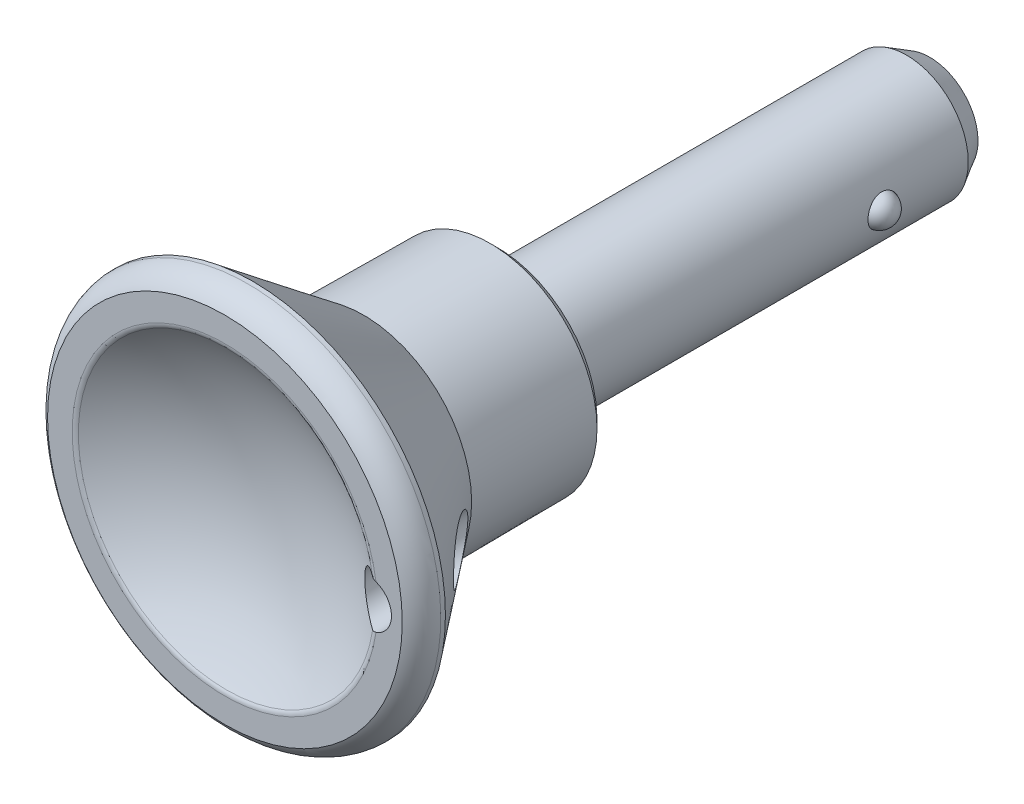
ISO-10303-21;
HEADER;
FILE_DESCRIPTION(('STEP AP214'),'2;1');
FILE_NAME('part.step','',(''),(''),'','','');
FILE_SCHEMA(('AUTOMOTIVE_DESIGN { 1 0 10303 214 1 1 1 1 }'));
ENDSEC;
DATA;
#1=APPLICATION_CONTEXT('core data for automotive mechanical design processes');
#2=APPLICATION_PROTOCOL_DEFINITION('international standard','automotive_design',2000,#1);
#3=PRODUCT_CONTEXT('',#1,'mechanical');
#4=PRODUCT('Part','Part','',(#3));
#5=PRODUCT_RELATED_PRODUCT_CATEGORY('part','',(#4));
#6=PRODUCT_DEFINITION_FORMATION('','',#4);
#7=PRODUCT_DEFINITION_CONTEXT('part definition',#1,'design');
#8=PRODUCT_DEFINITION('design','',#6,#7);
#9=PRODUCT_DEFINITION_SHAPE('','',#8);
#10=(LENGTH_UNIT() NAMED_UNIT(*) SI_UNIT(.MILLI.,.METRE.));
#11=(NAMED_UNIT(*) PLANE_ANGLE_UNIT() SI_UNIT($,.RADIAN.));
#12=(NAMED_UNIT(*) SI_UNIT($,.STERADIAN.) SOLID_ANGLE_UNIT());
#13=UNCERTAINTY_MEASURE_WITH_UNIT(LENGTH_MEASURE(1.E-05),#10,'distance_accuracy_value','');
#14=(GEOMETRIC_REPRESENTATION_CONTEXT(3) GLOBAL_UNCERTAINTY_ASSIGNED_CONTEXT((#13)) GLOBAL_UNIT_ASSIGNED_CONTEXT((#10,
#11,#12)) REPRESENTATION_CONTEXT('',''));
#15=CARTESIAN_POINT('',(0.,0.,0.));
#16=DIRECTION('',(0.,0.,1.));
#17=DIRECTION('',(1.,0.,0.));
#18=AXIS2_PLACEMENT_3D('',#15,#16,#17);
#19=CARTESIAN_POINT('',(3.13397459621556,-3.17158441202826,-28.));
#20=DIRECTION('',(0.,0.,-1.));
#21=DIRECTION('',(-1.,0.,0.));
#22=AXIS2_PLACEMENT_3D('',#19,#20,#21);
#23=PLANE('',#22);
#24=CARTESIAN_POINT('',(0.,0.,-28.));
#25=DIRECTION('',(0.,0.,1.));
#26=DIRECTION('',(0.,-1.,0.));
#27=AXIS2_PLACEMENT_3D('',#24,#25,#26);
#28=CIRCLE('',#27,3.13397459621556);
#29=CARTESIAN_POINT('',(0.,-3.13397459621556,-28.));
#30=VERTEX_POINT('',#29);
#31=EDGE_CURVE('E70',#30,#30,#28,.T.);
#32=ORIENTED_EDGE('',*,*,#31,.F.);
#33=EDGE_LOOP('',(#32));
#34=FACE_BOUND('',#33,.T.);
#35=ADVANCED_FACE('F14',(#34),#23,.T.);
#36=CARTESIAN_POINT('',(3.88177446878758,0.,-21.));
#37=DIRECTION('',(1.,0.,0.));
#38=DIRECTION('',(0.,-1.,0.));
#39=AXIS2_PLACEMENT_3D('',#36,#37,#38);
#40=CYLINDRICAL_SURFACE('',#39,1.);
#41=CARTESIAN_POINT('',(3.88177446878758,0.,-21.));
#42=DIRECTION('',(1.,0.,0.));
#43=DIRECTION('',(0.,-1.,0.));
#44=AXIS2_PLACEMENT_3D('',#41,#42,#43);
#45=CIRCLE('',#44,1.);
#46=CARTESIAN_POINT('',(3.88177451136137,-0.96531168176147,-21.2611002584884));
#47=VERTEX_POINT('',#46);
#48=CARTESIAN_POINT('',(3.88177446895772,0.96531185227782,-21.2610996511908));
#49=VERTEX_POINT('',#48);
#50=EDGE_CURVE('E17',#47,#49,#45,.T.);
#51=ORIENTED_EDGE('',*,*,#50,.F.);
#52=CARTESIAN_POINT('',(3.88177448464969,0.965311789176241,-21.2610998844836));
#53=CARTESIAN_POINT('',(3.88540385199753,0.950638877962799,-21.3155094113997));
#54=CARTESIAN_POINT('',(3.89014046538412,0.931319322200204,-21.3685420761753));
#55=CARTESIAN_POINT('',(3.90112983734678,0.884199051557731,-21.4704413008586));
#56=CARTESIAN_POINT('',(3.90738045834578,0.856410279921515,-21.5193136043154));
#57=CARTESIAN_POINT('',(3.92071189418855,0.793126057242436,-21.6116284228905));
#58=CARTESIAN_POINT('',(3.92779250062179,0.757632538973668,-21.6550722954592));
#59=CARTESIAN_POINT('',(3.94199278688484,0.679892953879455,-21.7354385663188));
#60=CARTESIAN_POINT('',(3.94911247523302,0.637645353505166,-21.7723594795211));
#61=CARTESIAN_POINT('',(3.96270366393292,0.546907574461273,-21.8391103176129));
#62=CARTESIAN_POINT('',(3.96916547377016,0.498343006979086,-21.8688412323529));
#63=CARTESIAN_POINT('',(3.9806028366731,0.396745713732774,-21.9196822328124));
#64=CARTESIAN_POINT('',(3.98557913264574,0.343715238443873,-21.9407966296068));
#65=CARTESIAN_POINT('',(3.99291972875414,0.242471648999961,-21.9713879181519));
#66=CARTESIAN_POINT('',(3.99555479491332,0.194645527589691,-21.9820925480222));
#67=CARTESIAN_POINT('',(3.99909511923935,0.0978826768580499,-21.9963986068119));
#68=CARTESIAN_POINT('',(4.00000061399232,0.0489461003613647,-22.0000010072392));
#69=CARTESIAN_POINT('',(3.99999930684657,-0.0552566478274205,-21.999998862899));
#70=CARTESIAN_POINT('',(3.99884379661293,-0.110525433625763,-21.9954052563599));
#71=CARTESIAN_POINT('',(3.99434700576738,-0.219475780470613,-21.9771816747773));
#72=CARTESIAN_POINT('',(3.9910047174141,-0.273156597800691,-21.9635475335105));
#73=CARTESIAN_POINT('',(3.98250420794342,-0.377347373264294,-21.9277072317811));
#74=CARTESIAN_POINT('',(3.97734807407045,-0.427860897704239,-21.9055109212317));
#75=CARTESIAN_POINT('',(3.96576893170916,-0.524447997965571,-21.8532124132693));
#76=CARTESIAN_POINT('',(3.95934587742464,-0.570521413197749,-21.8231099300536));
#77=CARTESIAN_POINT('',(3.94578204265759,-0.657873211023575,-21.7551953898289));
#78=CARTESIAN_POINT('',(3.93863012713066,-0.699046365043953,-21.7172502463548));
#79=CARTESIAN_POINT('',(3.92448848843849,-0.774509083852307,-21.6350198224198));
#80=CARTESIAN_POINT('',(3.91749874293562,-0.808799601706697,-21.5907354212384));
#81=CARTESIAN_POINT('',(3.90495270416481,-0.867284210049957,-21.5004846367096));
#82=CARTESIAN_POINT('',(3.8993282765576,-0.892041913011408,-21.4548922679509));
#83=CARTESIAN_POINT('',(3.88941506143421,-0.934286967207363,-21.3602904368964));
#84=CARTESIAN_POINT('',(3.88512710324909,-0.951769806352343,-21.3112788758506));
#85=CARTESIAN_POINT('',(3.88177448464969,-0.965311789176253,-21.2610998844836));
#86=B_SPLINE_CURVE_WITH_KNOTS('',3,(#52,#53,#54,#55,#56,#57,#58,#59,#60,#61,#62,#63,#64,#65,#66,
#67,#68,#69,#70,#71,#72,#73,#74,#75,#76,#77,#78,#79,#80,#81,#82,#83,#84,#85),.UNSPECIFIED.,.F.,
.F.,(4,2,2,2,2,2,2,2,2,2,2,2,2,2,2,2,4),(0.,0.169132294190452,0.338027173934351,
0.506879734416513,0.67577068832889,0.8468695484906,1.01788269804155,1.16458276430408,
1.31126276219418,1.47685399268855,1.6425215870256,1.80799916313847,1.97348272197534,
2.1420468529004,2.31058762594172,2.46651284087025,2.62253462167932),.UNSPECIFIED.);
#87=EDGE_CURVE('E50',#49,#47,#86,.T.);
#88=ORIENTED_EDGE('',*,*,#87,.F.);
#89=EDGE_LOOP('',(#51,#88));
#90=FACE_BOUND('',#89,.T.);
#91=ADVANCED_FACE('F53',(#90),#40,.F.);
#92=CARTESIAN_POINT('',(3.74,0.,-21.));
#93=DIRECTION('',(0.,-1.,0.));
#94=DIRECTION('',(0.,0.,-1.));
#95=AXIS2_PLACEMENT_3D('',#92,#93,#94);
#96=SPHERICAL_SURFACE('',#95,1.01);
#97=CARTESIAN_POINT('',(3.88177455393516,0.965311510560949,-20.7388991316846));
#98=CARTESIAN_POINT('',(3.87947589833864,0.974537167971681,-20.7717537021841));
#99=CARTESIAN_POINT('',(3.87758596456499,0.982015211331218,-20.8051052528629));
#100=CARTESIAN_POINT('',(3.87470673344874,0.993322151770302,-20.8719408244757));
#101=CARTESIAN_POINT('',(3.8737042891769,0.997204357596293,-20.9054152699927));
#102=CARTESIAN_POINT('',(3.87228725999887,1.00270077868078,-20.9925132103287));
#103=CARTESIAN_POINT('',(3.87257020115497,1.00161876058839,-21.0463531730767));
#104=CARTESIAN_POINT('',(3.87471439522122,0.993273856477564,-21.1269570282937));
#105=CARTESIAN_POINT('',(3.87573945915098,0.989279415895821,-21.1541316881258));
#106=CARTESIAN_POINT('',(3.87834788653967,0.979001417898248,-21.2080101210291));
#107=CARTESIAN_POINT('',(3.87993110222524,0.972718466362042,-21.2347140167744));
#108=CARTESIAN_POINT('',(3.88177455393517,0.965311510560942,-21.2611008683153));
#109=B_SPLINE_CURVE_WITH_KNOTS('',3,(#97,#98,#99,#100,#101,#102,#103,#104,#105,#106,#107,#108),
.UNSPECIFIED.,.F.,.F.,(4,2,2,2,2,4),(0.,0.102513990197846,0.203482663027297,0.364121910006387,
0.44649117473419,0.528838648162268),.UNSPECIFIED.);
#110=CARTESIAN_POINT('',(3.88177451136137,0.965311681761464,-20.7388997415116));
#111=VERTEX_POINT('',#110);
#112=EDGE_CURVE('E68',#111,#49,#109,.T.);
#113=ORIENTED_EDGE('',*,*,#112,.F.);
#114=CARTESIAN_POINT('',(3.88177446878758,0.,-21.));
#115=DIRECTION('',(1.,0.,0.));
#116=DIRECTION('',(0.,-1.,0.));
#117=AXIS2_PLACEMENT_3D('',#114,#115,#116);
#118=CIRCLE('',#117,1.);
#119=CARTESIAN_POINT('',(3.88177446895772,-0.96531185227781,-20.7389003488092));
#120=VERTEX_POINT('',#119);
#121=EDGE_CURVE('E57',#120,#111,#118,.F.);
#122=ORIENTED_EDGE('',*,*,#121,.F.);
#123=CARTESIAN_POINT('',(3.88177455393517,-0.965311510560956,-21.2611008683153));
#124=CARTESIAN_POINT('',(3.87947589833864,-0.974537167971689,-21.2282462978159));
#125=CARTESIAN_POINT('',(3.87758596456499,-0.982015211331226,-21.1948947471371));
#126=CARTESIAN_POINT('',(3.87470673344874,-0.99332215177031,-21.1280591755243));
#127=CARTESIAN_POINT('',(3.8737042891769,-0.9972043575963,-21.0945847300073));
#128=CARTESIAN_POINT('',(3.87228725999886,-1.00270077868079,-21.0074867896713));
#129=CARTESIAN_POINT('',(3.87257020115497,-1.00161876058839,-20.9536468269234));
#130=CARTESIAN_POINT('',(3.87471439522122,-0.993273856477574,-20.8730429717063));
#131=CARTESIAN_POINT('',(3.87573945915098,-0.989279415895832,-20.8458683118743));
#132=CARTESIAN_POINT('',(3.87834788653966,-0.979001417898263,-20.791989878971));
#133=CARTESIAN_POINT('',(3.87993110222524,-0.97271846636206,-20.7652859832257));
#134=CARTESIAN_POINT('',(3.88177455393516,-0.965311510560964,-20.7388991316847));
#135=B_SPLINE_CURVE_WITH_KNOTS('',3,(#123,#124,#125,#126,#127,#128,#129,#130,#131,#132,#133,
#134),.UNSPECIFIED.,.F.,.F.,(4,2,2,2,2,4),(0.,0.102513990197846,0.203482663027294,
0.36412191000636,0.446491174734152,0.528838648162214),.UNSPECIFIED.);
#136=EDGE_CURVE('E59',#47,#120,#135,.T.);
#137=ORIENTED_EDGE('',*,*,#136,.F.);
#138=ORIENTED_EDGE('',*,*,#50,.T.);
#139=EDGE_LOOP('',(#113,#122,#137,#138));
#140=FACE_BOUND('',#139,.T.);
#141=ADVANCED_FACE('F60',(#140),#96,.T.);
#142=CARTESIAN_POINT('',(3.88177446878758,0.,-21.));
#143=DIRECTION('',(1.,0.,0.));
#144=DIRECTION('',(0.,-1.,0.));
#145=AXIS2_PLACEMENT_3D('',#142,#143,#144);
#146=CYLINDRICAL_SURFACE('',#145,1.);
#147=CARTESIAN_POINT('',(3.88177448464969,-0.96531178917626,-20.7389001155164));
#148=CARTESIAN_POINT('',(3.88540385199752,-0.950638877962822,-20.6844905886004));
#149=CARTESIAN_POINT('',(3.89014046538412,-0.931319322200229,-20.6314579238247));
#150=CARTESIAN_POINT('',(3.90112983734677,-0.88419905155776,-20.5295586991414));
#151=CARTESIAN_POINT('',(3.90738045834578,-0.856410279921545,-20.4806863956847));
#152=CARTESIAN_POINT('',(3.92071189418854,-0.793126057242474,-20.3883715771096));
#153=CARTESIAN_POINT('',(3.92779250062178,-0.757632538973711,-20.3449277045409));
#154=CARTESIAN_POINT('',(3.94199278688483,-0.679892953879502,-20.2645614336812));
#155=CARTESIAN_POINT('',(3.94911247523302,-0.637645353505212,-20.2276405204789));
#156=CARTESIAN_POINT('',(3.96270366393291,-0.546907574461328,-20.1608896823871));
#157=CARTESIAN_POINT('',(3.96916547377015,-0.49834300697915,-20.1311587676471));
#158=CARTESIAN_POINT('',(3.98060283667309,-0.396745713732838,-20.0803177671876));
#159=CARTESIAN_POINT('',(3.98557913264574,-0.343715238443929,-20.0592033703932));
#160=CARTESIAN_POINT('',(3.99291972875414,-0.242471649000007,-20.0286120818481));
#161=CARTESIAN_POINT('',(3.99555479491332,-0.194645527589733,-20.0179074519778));
#162=CARTESIAN_POINT('',(3.99909511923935,-0.0978826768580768,-20.0036013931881));
#163=CARTESIAN_POINT('',(4.00000061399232,-0.0489461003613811,-19.9999989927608));
#164=CARTESIAN_POINT('',(3.99999930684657,0.0552566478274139,-20.000001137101));
#165=CARTESIAN_POINT('',(3.99884379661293,0.110525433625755,-20.0045947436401));
#166=CARTESIAN_POINT('',(3.99434700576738,0.219475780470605,-20.0228183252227));
#167=CARTESIAN_POINT('',(3.9910047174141,0.273156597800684,-20.0364524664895));
#168=CARTESIAN_POINT('',(3.98250420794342,0.377347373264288,-20.0722927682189));
#169=CARTESIAN_POINT('',(3.97734807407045,0.427860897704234,-20.0944890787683));
#170=CARTESIAN_POINT('',(3.96576893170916,0.524447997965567,-20.1467875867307));
#171=CARTESIAN_POINT('',(3.95934587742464,0.570521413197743,-20.1768900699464));
#172=CARTESIAN_POINT('',(3.94578204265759,0.657873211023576,-20.2448046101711));
#173=CARTESIAN_POINT('',(3.93863012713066,0.69904636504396,-20.2827497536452));
#174=CARTESIAN_POINT('',(3.92448848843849,0.77450908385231,-20.3649801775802));
#175=CARTESIAN_POINT('',(3.91749874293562,0.80879960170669,-20.4092645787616));
#176=CARTESIAN_POINT('',(3.90495270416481,0.867284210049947,-20.4995153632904));
#177=CARTESIAN_POINT('',(3.8993282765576,0.892041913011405,-20.5451077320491));
#178=CARTESIAN_POINT('',(3.8894150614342,0.93428696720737,-20.6397095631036));
#179=CARTESIAN_POINT('',(3.88512710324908,0.951769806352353,-20.6887211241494));
#180=CARTESIAN_POINT('',(3.88177448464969,0.965311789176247,-20.7389001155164));
#181=B_SPLINE_CURVE_WITH_KNOTS('',3,(#147,#148,#149,#150,#151,#152,#153,#154,#155,#156,#157,
#158,#159,#160,#161,#162,#163,#164,#165,#166,#167,#168,#169,#170,#171,#172,#173,#174,#175,#176,
#177,#178,#179,#180),.UNSPECIFIED.,.F.,.F.,(4,2,2,2,2,2,2,2,2,2,2,2,2,2,2,2,4),(0.,
0.169132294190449,0.338027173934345,0.506879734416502,0.675770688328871,0.846869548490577,
1.01788269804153,1.16458276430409,1.31126276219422,1.47685399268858,1.64252158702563,
1.80799916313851,1.97348272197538,2.14204685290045,2.3105876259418,2.46651284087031,
2.62253462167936),.UNSPECIFIED.);
#182=EDGE_CURVE('E64',#120,#111,#181,.T.);
#183=ORIENTED_EDGE('',*,*,#182,.F.);
#184=ORIENTED_EDGE('',*,*,#121,.T.);
#185=EDGE_LOOP('',(#183,#184));
#186=FACE_BOUND('',#185,.T.);
#187=ADVANCED_FACE('F97',(#186),#146,.F.);
#188=CARTESIAN_POINT('',(0.,0.,-28.));
#189=DIRECTION('',(0.,0.,1.));
#190=DIRECTION('',(0.,-1.,0.));
#191=AXIS2_PLACEMENT_3D('',#188,#189,#190);
#192=CONICAL_SURFACE('',#191,3.13397459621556,0.523598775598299);
#193=CARTESIAN_POINT('',(0.,0.,-26.5));
#194=DIRECTION('',(0.,0.,1.));
#195=DIRECTION('',(1.,0.,0.));
#196=AXIS2_PLACEMENT_3D('',#193,#194,#195);
#197=CIRCLE('',#196,4.);
#198=CARTESIAN_POINT('',(4.,0.,-26.5));
#199=VERTEX_POINT('',#198);
#200=EDGE_CURVE('E102',#199,#199,#197,.T.);
#201=ORIENTED_EDGE('',*,*,#200,.F.);
#202=EDGE_LOOP('',(#201));
#203=FACE_BOUND('',#202,.T.);
#204=ORIENTED_EDGE('',*,*,#31,.T.);
#205=EDGE_LOOP('',(#204));
#206=FACE_BOUND('',#205,.T.);
#207=ADVANCED_FACE('F201',(#203,#206),#192,.T.);
#208=CARTESIAN_POINT('',(0.,0.,0.));
#209=DIRECTION('',(0.,0.,1.));
#210=DIRECTION('',(0.,-1.,0.));
#211=AXIS2_PLACEMENT_3D('',#208,#209,#210);
#212=CYLINDRICAL_SURFACE('',#211,4.);
#213=ORIENTED_EDGE('',*,*,#112,.T.);
#214=ORIENTED_EDGE('',*,*,#87,.T.);
#215=ORIENTED_EDGE('',*,*,#136,.T.);
#216=ORIENTED_EDGE('',*,*,#182,.T.);
#217=EDGE_LOOP('',(#213,#214,#215,#216));
#218=FACE_BOUND('',#217,.T.);
#219=CARTESIAN_POINT('',(0.,0.,0.));
#220=DIRECTION('',(0.,0.,1.));
#221=DIRECTION('',(0.,-1.,0.));
#222=AXIS2_PLACEMENT_3D('',#219,#220,#221);
#223=CIRCLE('',#222,4.);
#224=CARTESIAN_POINT('',(0.,-4.,0.));
#225=VERTEX_POINT('',#224);
#226=EDGE_CURVE('E186',#225,#225,#223,.T.);
#227=ORIENTED_EDGE('',*,*,#226,.F.);
#228=EDGE_LOOP('',(#227));
#229=FACE_BOUND('',#228,.T.);
#230=ORIENTED_EDGE('',*,*,#200,.T.);
#231=EDGE_LOOP('',(#230));
#232=FACE_BOUND('',#231,.T.);
#233=ADVANCED_FACE('F66',(#218,#229,#232),#212,.T.);
#234=CARTESIAN_POINT('',(6.4240762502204,-6.50116727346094,0.));
#235=DIRECTION('',(0.,0.,-1.));
#236=DIRECTION('',(-1.,0.,0.));
#237=AXIS2_PLACEMENT_3D('',#234,#235,#236);
#238=PLANE('',#237);
#239=ORIENTED_EDGE('',*,*,#226,.T.);
#240=EDGE_LOOP('',(#239));
#241=FACE_BOUND('',#240,.T.);
#242=CARTESIAN_POINT('',(0.,0.,0.));
#243=DIRECTION('',(0.,0.,1.));
#244=DIRECTION('',(0.,-1.,0.));
#245=AXIS2_PLACEMENT_3D('',#242,#243,#244);
#246=CIRCLE('',#245,6.4240762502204);
#247=CARTESIAN_POINT('',(0.,-6.4240762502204,0.));
#248=VERTEX_POINT('',#247);
#249=EDGE_CURVE('E154',#248,#248,#246,.T.);
#250=ORIENTED_EDGE('',*,*,#249,.F.);
#251=EDGE_LOOP('',(#250));
#252=FACE_BOUND('',#251,.T.);
#253=ADVANCED_FACE('F234',(#241,#252),#238,.T.);
#254=CARTESIAN_POINT('',(0.,0.,0.));
#255=DIRECTION('',(0.,0.,1.));
#256=DIRECTION('',(0.,-1.,0.));
#257=AXIS2_PLACEMENT_3D('',#254,#255,#256);
#258=CONICAL_SURFACE('',#257,6.4240762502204,0.789761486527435);
#259=CARTESIAN_POINT('',(0.,0.,0.499980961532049));
#260=DIRECTION('',(0.,0.,-1.));
#261=DIRECTION('',(1.,0.,0.));
#262=AXIS2_PLACEMENT_3D('',#259,#260,#261);
#263=CIRCLE('',#262,6.92843951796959);
#264=CARTESIAN_POINT('',(6.92843951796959,0.,0.499980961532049));
#265=VERTEX_POINT('',#264);
#266=EDGE_CURVE('E180',#265,#265,#263,.F.);
#267=ORIENTED_EDGE('',*,*,#266,.F.);
#268=EDGE_LOOP('',(#267));
#269=FACE_BOUND('',#268,.T.);
#270=ORIENTED_EDGE('',*,*,#249,.T.);
#271=EDGE_LOOP('',(#270));
#272=FACE_BOUND('',#271,.T.);
#273=ADVANCED_FACE('F240',(#269,#272),#258,.T.);
#274=CARTESIAN_POINT('',(0.,0.,0.499980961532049));
#275=DIRECTION('',(0.,0.,1.));
#276=DIRECTION('',(0.,-1.,0.));
#277=AXIS2_PLACEMENT_3D('',#274,#275,#276);
#278=CONICAL_SURFACE('',#277,6.92843951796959,0.00872664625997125);
#279=CARTESIAN_POINT('',(0.,0.,8.7));
#280=DIRECTION('',(0.,0.,-1.));
#281=DIRECTION('',(1.,0.,0.));
#282=AXIS2_PLACEMENT_3D('',#279,#280,#281);
#283=CIRCLE('',#282,7.);
#284=CARTESIAN_POINT('',(7.,0.,8.7));
#285=VERTEX_POINT('',#284);
#286=EDGE_CURVE('E176',#285,#285,#283,.F.);
#287=ORIENTED_EDGE('',*,*,#286,.F.);
#288=EDGE_LOOP('',(#287));
#289=FACE_BOUND('',#288,.T.);
#290=ORIENTED_EDGE('',*,*,#266,.T.);
#291=EDGE_LOOP('',(#290));
#292=FACE_BOUND('',#291,.T.);
#293=ADVANCED_FACE('F246',(#289,#292),#278,.T.);
#294=CARTESIAN_POINT('',(0.,0.,16.2));
#295=DIRECTION('',(0.,0.,1.));
#296=DIRECTION('',(0.,-1.,0.));
#297=AXIS2_PLACEMENT_3D('',#294,#295,#296);
#298=CYLINDRICAL_SURFACE('',#297,12.5);
#299=CARTESIAN_POINT('',(0.,0.,15.9));
#300=DIRECTION('',(0.,0.,-1.));
#301=DIRECTION('',(1.,0.,0.));
#302=AXIS2_PLACEMENT_3D('',#299,#300,#301);
#303=CIRCLE('',#302,12.5);
#304=CARTESIAN_POINT('',(12.5,0.,15.9));
#305=VERTEX_POINT('',#304);
#306=EDGE_CURVE('E177',#305,#305,#303,.T.);
#307=ORIENTED_EDGE('',*,*,#306,.F.);
#308=EDGE_LOOP('',(#307));
#309=FACE_BOUND('',#308,.T.);
#310=CARTESIAN_POINT('',(0.,0.,16.2));
#311=DIRECTION('',(0.,0.,1.));
#312=DIRECTION('',(0.,-1.,0.));
#313=AXIS2_PLACEMENT_3D('',#310,#311,#312);
#314=CIRCLE('',#313,12.5);
#315=CARTESIAN_POINT('',(0.,-12.5,16.2));
#316=VERTEX_POINT('',#315);
#317=EDGE_CURVE('E153',#316,#316,#314,.T.);
#318=ORIENTED_EDGE('',*,*,#317,.F.);
#319=EDGE_LOOP('',(#318));
#320=FACE_BOUND('',#319,.T.);
#321=ADVANCED_FACE('F254',(#309,#320),#298,.T.);
#322=CARTESIAN_POINT('',(0.,0.,8.7));
#323=DIRECTION('',(0.,0.,1.));
#324=DIRECTION('',(0.,-1.,0.));
#325=AXIS2_PLACEMENT_3D('',#322,#323,#324);
#326=CONICAL_SURFACE('',#325,7.,0.65233090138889);
#327=CARTESIAN_POINT('',(9.05806451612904,-1.48036050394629,11.5515077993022));
#328=CARTESIAN_POINT('',(8.99141512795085,-1.46946825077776,11.4631001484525));
#329=CARTESIAN_POINT('',(8.92550148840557,-1.45408557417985,11.3746905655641));
#330=CARTESIAN_POINT('',(8.79556366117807,-1.41427171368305,11.1984472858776));
#331=CARTESIAN_POINT('',(8.73154031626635,-1.38983655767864,11.1106138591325));
#332=CARTESIAN_POINT('',(8.60623315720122,-1.33170423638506,10.9367585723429));
#333=CARTESIAN_POINT('',(8.54493725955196,-1.29805393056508,10.8507298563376));
#334=CARTESIAN_POINT('',(8.42544336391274,-1.22074353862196,10.6811358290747));
#335=CARTESIAN_POINT('',(8.36724184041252,-1.17709515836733,10.5975677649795));
#336=CARTESIAN_POINT('',(8.2692294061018,-1.09114708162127,10.4552980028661));
#337=CARTESIAN_POINT('',(8.22852162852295,-1.05135683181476,10.3957022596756));
#338=CARTESIAN_POINT('',(8.14989980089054,-0.964725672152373,10.2796936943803));
#339=CARTESIAN_POINT('',(8.11198828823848,-0.917878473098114,10.2232837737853));
#340=CARTESIAN_POINT('',(8.03963417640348,-0.815744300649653,10.1148327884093));
#341=CARTESIAN_POINT('',(8.00522654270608,-0.760383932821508,10.0628364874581));
#342=CARTESIAN_POINT('',(7.94192848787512,-0.640477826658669,9.96655825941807));
#343=CARTESIAN_POINT('',(7.91302454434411,-0.575955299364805,9.92225744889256));
#344=CARTESIAN_POINT('',(7.87251252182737,-0.463057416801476,9.85986137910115));
#345=CARTESIAN_POINT('',(7.85846623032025,-0.417573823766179,9.83814176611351));
#346=CARTESIAN_POINT('',(7.83441768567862,-0.323152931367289,9.80086955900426));
#347=CARTESIAN_POINT('',(7.82440740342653,-0.274222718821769,9.78530472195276));
#348=CARTESIAN_POINT('',(7.81132335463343,-0.187620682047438,9.76493500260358));
#349=CARTESIAN_POINT('',(7.80710048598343,-0.150537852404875,9.75835039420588));
#350=CARTESIAN_POINT('',(7.80143783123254,-0.0756412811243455,9.74951765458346));
#351=CARTESIAN_POINT('',(7.79999798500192,-0.0378275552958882,9.74726942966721));
#352=CARTESIAN_POINT('',(7.8000025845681,0.048520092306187,9.74727695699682));
#353=CARTESIAN_POINT('',(7.80237736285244,0.097062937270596,9.75098545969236));
#354=CARTESIAN_POINT('',(7.81164444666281,0.192651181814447,9.76543406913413));
#355=CARTESIAN_POINT('',(7.81854204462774,0.239694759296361,9.77618241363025));
#356=CARTESIAN_POINT('',(7.83829683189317,0.341610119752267,9.80688772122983));
#357=CARTESIAN_POINT('',(7.85215507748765,0.39581717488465,9.82838678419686));
#358=CARTESIAN_POINT('',(7.8845198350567,0.499375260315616,9.87838349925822));
#359=CARTESIAN_POINT('',(7.90303499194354,0.548717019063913,9.9068941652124));
#360=CARTESIAN_POINT('',(7.95423062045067,0.66706820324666,9.98533549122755));
#361=CARTESIAN_POINT('',(7.9892435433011,0.732796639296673,10.0386516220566));
#362=CARTESIAN_POINT('',(8.06472209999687,0.853932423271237,10.1525776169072));
#363=CARTESIAN_POINT('',(8.10520064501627,0.909314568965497,10.2132047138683));
#364=CARTESIAN_POINT('',(8.18383548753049,1.00367842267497,10.3298982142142));
#365=CARTESIAN_POINT('',(8.22147534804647,1.04387385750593,10.3853483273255));
#366=CARTESIAN_POINT('',(8.29898008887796,1.11841530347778,10.4986148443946));
#367=CARTESIAN_POINT('',(8.33884646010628,1.15275733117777,10.556432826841));
#368=CARTESIAN_POINT('',(8.42042546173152,1.21614962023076,10.6737908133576));
#369=CARTESIAN_POINT('',(8.46214099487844,1.24519116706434,10.7333334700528));
#370=CARTESIAN_POINT('',(8.54706483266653,1.29830522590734,10.8535675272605));
#371=CARTESIAN_POINT('',(8.59027353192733,1.32237641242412,10.9142592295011));
#372=CARTESIAN_POINT('',(8.69675324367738,1.37513054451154,11.0626135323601));
#373=CARTESIAN_POINT('',(8.76068198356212,1.40136483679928,11.150681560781));
#374=CARTESIAN_POINT('',(8.89058399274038,1.44466814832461,11.3275915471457));
#375=CARTESIAN_POINT('',(8.95655819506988,1.46173291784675,11.4164338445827));
#376=CARTESIAN_POINT('',(9.09008194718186,1.48679092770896,11.5942301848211));
#377=CARTESIAN_POINT('',(9.15763151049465,1.4947840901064,11.683184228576));
#378=CARTESIAN_POINT('',(9.29378809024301,1.50153429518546,11.8605390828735));
#379=CARTESIAN_POINT('',(9.36239469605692,1.5002948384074,11.9489400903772));
#380=CARTESIAN_POINT('',(9.53896432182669,1.48478544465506,12.1740527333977));
#381=CARTESIAN_POINT('',(9.64741582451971,1.46359594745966,12.3100469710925));
#382=CARTESIAN_POINT('',(9.80896256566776,1.41213790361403,12.5095339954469));
#383=CARTESIAN_POINT('',(9.86259038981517,1.39172486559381,12.5752398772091));
#384=CARTESIAN_POINT('',(9.96902195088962,1.34380635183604,12.7046889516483));
#385=CARTESIAN_POINT('',(10.021826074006,1.31630431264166,12.7684330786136));
#386=CARTESIAN_POINT('',(10.1398540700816,1.2452226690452,12.9099256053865));
#387=CARTESIAN_POINT('',(10.2046458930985,1.19931241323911,12.9868895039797));
#388=CARTESIAN_POINT('',(10.3299573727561,1.09357010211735,13.1345591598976));
#389=CARTESIAN_POINT('',(10.3904821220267,1.03375502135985,13.2052724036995));
#390=CARTESIAN_POINT('',(10.4895745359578,0.916081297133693,13.3202576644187));
#391=CARTESIAN_POINT('',(10.5297805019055,0.861692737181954,13.3666468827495));
#392=CARTESIAN_POINT('',(10.6043536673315,0.743973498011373,13.452316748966));
#393=CARTESIAN_POINT('',(10.6387288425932,0.680655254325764,13.4916071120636));
#394=CARTESIAN_POINT('',(10.6925693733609,0.560424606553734,13.5529446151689));
#395=CARTESIAN_POINT('',(10.7136506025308,0.505208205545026,13.5768833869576));
#396=CARTESIAN_POINT('',(10.7495749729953,0.390302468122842,13.6176027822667));
#397=CARTESIAN_POINT('',(10.7644289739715,0.330621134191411,13.6343958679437));
#398=CARTESIAN_POINT('',(10.7836092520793,0.225596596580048,13.6560593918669));
#399=CARTESIAN_POINT('',(10.7897268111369,0.180990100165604,13.6629607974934));
#400=CARTESIAN_POINT('',(10.7979243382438,0.0909301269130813,13.6722061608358));
#401=CARTESIAN_POINT('',(10.8000037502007,0.0454765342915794,13.6745494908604));
#402=CARTESIAN_POINT('',(10.799994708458,-0.064167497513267,13.6745397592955));
#403=CARTESIAN_POINT('',(10.795841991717,-0.128380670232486,13.6698606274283));
#404=CARTESIAN_POINT('',(10.7796239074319,-0.254506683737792,13.6515601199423));
#405=CARTESIAN_POINT('',(10.7675483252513,-0.316416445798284,13.6379272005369));
#406=CARTESIAN_POINT('',(10.7366563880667,-0.435644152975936,13.6029693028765));
#407=CARTESIAN_POINT('',(10.7178919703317,-0.492993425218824,13.5817035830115));
#408=CARTESIAN_POINT('',(10.6748799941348,-0.602645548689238,13.5328118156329));
#409=CARTESIAN_POINT('',(10.6506301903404,-0.65494632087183,13.5051831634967));
#410=CARTESIAN_POINT('',(10.5859735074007,-0.776472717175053,13.4312530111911));
#411=CARTESIAN_POINT('',(10.5432056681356,-0.842728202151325,13.3821425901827));
#412=CARTESIAN_POINT('',(10.4516580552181,-0.964099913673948,13.2763616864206));
#413=CARTESIAN_POINT('',(10.4028645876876,-1.01918998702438,13.2196739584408));
#414=CARTESIAN_POINT('',(10.2766029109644,-1.14345503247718,13.0719673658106));
#415=CARTESIAN_POINT('',(10.1967753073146,-1.20635475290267,12.9777102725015));
#416=CARTESIAN_POINT('',(10.0329696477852,-1.3123614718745,12.7820645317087));
#417=CARTESIAN_POINT('',(9.94898466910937,-1.35543413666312,12.6806638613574));
#418=CARTESIAN_POINT('',(9.79718248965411,-1.41705079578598,12.4951419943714));
#419=CARTESIAN_POINT('',(9.72964852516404,-1.43883766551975,12.4118303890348));
#420=CARTESIAN_POINT('',(9.59439459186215,-1.47247845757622,12.2433068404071));
#421=CARTESIAN_POINT('',(9.52667453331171,-1.48432617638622,12.1580937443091));
#422=CARTESIAN_POINT('',(9.39151350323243,-1.49875216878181,11.9862568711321));
#423=CARTESIAN_POINT('',(9.32407407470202,-1.50130123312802,11.8996295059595));
#424=CARTESIAN_POINT('',(9.19020636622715,-1.49747387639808,11.725837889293));
#425=CARTESIAN_POINT('',(9.12377782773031,-1.49109977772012,11.6386737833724));
#426=CARTESIAN_POINT('',(9.05806451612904,-1.48036050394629,11.5515077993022));
#427=B_SPLINE_CURVE_WITH_KNOTS('',3,(#327,#328,#329,#330,#331,#332,#333,#334,#335,#336,#337,
#338,#339,#340,#341,#342,#343,#344,#345,#346,#347,#348,#349,#350,#351,#352,#353,#354,#355,#356,
#357,#358,#359,#360,#361,#362,#363,#364,#365,#366,#367,#368,#369,#370,#371,#372,#373,#374,#375,
#376,#377,#378,#379,#380,#381,#382,#383,#384,#385,#386,#387,#388,#389,#390,#391,#392,#393,#394,
#395,#396,#397,#398,#399,#400,#401,#402,#403,#404,#405,#406,#407,#408,#409,#410,#411,#412,#413,
#414,#415,#416,#417,#418,#419,#420,#421,#422,#423,#424,#425,#426),.UNSPECIFIED.,.T.,.F.,(4,2,2,
2,2,2,2,2,2,2,2,2,2,2,2,2,2,2,2,2,2,2,2,2,2,2,2,2,2,2,2,2,2,2,2,2,2,2,2,2,2,2,2,2,2,2,2,2,2,4),
(0.,0.333658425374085,0.667463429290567,0.999601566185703,1.33135280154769,1.57826788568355,
1.82540433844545,2.07480511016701,2.32358497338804,2.4800563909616,2.63621497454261,
2.74958301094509,2.86294859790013,3.00835870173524,3.15393926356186,3.33275537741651,
3.51190592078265,3.78514778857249,4.0590467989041,4.29316938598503,4.52745067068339,
4.76211373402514,4.9968392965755,5.33221840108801,5.66775280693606,6.00329009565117,
6.33870017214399,6.86226215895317,7.12372139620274,7.38505412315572,7.71589293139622,
8.04632996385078,8.29159071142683,8.5365132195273,8.72709088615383,8.91733480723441,
9.05359735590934,9.18987866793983,9.38217192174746,9.57471358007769,9.76579164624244,
9.95694806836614,10.2340958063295,10.5118854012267,10.9254412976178,11.3397106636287,
11.6675345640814,11.995562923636,12.3246208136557,12.6535930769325),.UNSPECIFIED.);
#428=CARTESIAN_POINT('',(9.05806451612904,-1.48036050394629,11.5515077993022));
#429=VERTEX_POINT('',#428);
#430=EDGE_CURVE('E141',#429,#429,#427,.T.);
#431=ORIENTED_EDGE('',*,*,#430,.F.);
#432=EDGE_LOOP('',(#431));
#433=FACE_BOUND('',#432,.T.);
#434=ORIENTED_EDGE('',*,*,#306,.T.);
#435=EDGE_LOOP('',(#434));
#436=FACE_BOUND('',#435,.T.);
#437=ORIENTED_EDGE('',*,*,#286,.T.);
#438=EDGE_LOOP('',(#437));
#439=FACE_BOUND('',#438,.T.);
#440=ADVANCED_FACE('F262',(#433,#436,#439),#326,.T.);
#441=CARTESIAN_POINT('',(0.,0.,15.9596620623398));
#442=DIRECTION('',(0.,0.,1.));
#443=DIRECTION('',(0.,-1.,0.));
#444=AXIS2_PLACEMENT_3D('',#441,#442,#443);
#445=TOROIDAL_SURFACE('',#444,10.5144930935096,2.);
#446=ORIENTED_EDGE('',*,*,#317,.T.);
#447=EDGE_LOOP('',(#446));
#448=FACE_BOUND('',#447,.T.);
#449=CARTESIAN_POINT('',(0.,0.,17.7));
#450=DIRECTION('',(0.,0.,1.));
#451=DIRECTION('',(0.,-1.,0.));
#452=AXIS2_PLACEMENT_3D('',#449,#450,#451);
#453=CIRCLE('',#452,11.5);
#454=CARTESIAN_POINT('',(0.,-11.5,17.7));
#455=VERTEX_POINT('',#454);
#456=EDGE_CURVE('E108',#455,#455,#453,.T.);
#457=ORIENTED_EDGE('',*,*,#456,.F.);
#458=EDGE_LOOP('',(#457));
#459=FACE_BOUND('',#458,.T.);
#460=ADVANCED_FACE('F135',(#448,#459),#445,.T.);
#461=CARTESIAN_POINT('',(9.3,0.,9.74688245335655));
#462=DIRECTION('',(0.,0.,1.));
#463=DIRECTION('',(0.,-1.,0.));
#464=AXIS2_PLACEMENT_3D('',#461,#462,#463);
#465=CYLINDRICAL_SURFACE('',#464,1.5);
#466=ORIENTED_EDGE('',*,*,#430,.T.);
#467=EDGE_LOOP('',(#466));
#468=FACE_BOUND('',#467,.T.);
#469=CARTESIAN_POINT('',(9.79838709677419,-1.41478277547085,17.7));
#470=CARTESIAN_POINT('',(9.7696746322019,-1.42493393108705,17.7000278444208));
#471=CARTESIAN_POINT('',(9.74057958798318,-1.43416331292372,17.6978154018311));
#472=CARTESIAN_POINT('',(9.68339626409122,-1.45046247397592,17.688811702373));
#473=CARTESIAN_POINT('',(9.65530246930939,-1.45758512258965,17.6821493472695));
#474=CARTESIAN_POINT('',(9.60265119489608,-1.46937623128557,17.6649718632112));
#475=CARTESIAN_POINT('',(9.5780018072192,-1.47420693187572,17.6548534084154));
#476=CARTESIAN_POINT('',(9.52973678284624,-1.48251466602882,17.6305344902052));
#477=CARTESIAN_POINT('',(9.50616459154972,-1.48595330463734,17.6162348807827));
#478=CARTESIAN_POINT('',(9.48387096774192,-1.48868783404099,17.6));
#479=B_SPLINE_CURVE_WITH_KNOTS('',3,(#469,#470,#471,#472,#473,#474,#475,#476,#477,#478),
.UNSPECIFIED.,.F.,.F.,(4,2,2,2,4),(0.,0.091347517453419,0.180157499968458,0.261045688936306,
0.34403364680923),.UNSPECIFIED.);
#480=CARTESIAN_POINT('',(9.79838709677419,-1.41478277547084,17.7));
#481=VERTEX_POINT('',#480);
#482=CARTESIAN_POINT('',(9.48387096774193,-1.48868783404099,17.6));
#483=VERTEX_POINT('',#482);
#484=EDGE_CURVE('E120',#481,#483,#479,.T.);
#485=ORIENTED_EDGE('',*,*,#484,.F.);
#486=CARTESIAN_POINT('',(9.3,0.,17.7));
#487=DIRECTION('',(0.,0.,1.));
#488=DIRECTION('',(0.,-1.,0.));
#489=AXIS2_PLACEMENT_3D('',#486,#487,#488);
#490=CIRCLE('',#489,1.5);
#491=CARTESIAN_POINT('',(9.79838709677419,1.41478277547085,17.7));
#492=VERTEX_POINT('',#491);
#493=EDGE_CURVE('E32',#492,#481,#490,.F.);
#494=ORIENTED_EDGE('',*,*,#493,.F.);
#495=CARTESIAN_POINT('',(9.79838709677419,1.41478277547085,17.7));
#496=CARTESIAN_POINT('',(9.76967463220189,1.42493393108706,17.7000278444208));
#497=CARTESIAN_POINT('',(9.74057958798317,1.43416331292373,17.6978154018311));
#498=CARTESIAN_POINT('',(9.68339626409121,1.45046247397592,17.688811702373));
#499=CARTESIAN_POINT('',(9.65530246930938,1.45758512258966,17.6821493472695));
#500=CARTESIAN_POINT('',(9.60265119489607,1.46937623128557,17.6649718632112));
#501=CARTESIAN_POINT('',(9.57800180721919,1.47420693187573,17.6548534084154));
#502=CARTESIAN_POINT('',(9.52973678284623,1.48251466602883,17.6305344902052));
#503=CARTESIAN_POINT('',(9.50616459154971,1.48595330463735,17.6162348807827));
#504=CARTESIAN_POINT('',(9.48387096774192,1.48868783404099,17.6));
#505=B_SPLINE_CURVE_WITH_KNOTS('',3,(#495,#496,#497,#498,#499,#500,#501,#502,#503,#504),
.UNSPECIFIED.,.F.,.F.,(4,2,2,2,4),(0.,0.0913475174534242,0.180157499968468,0.261045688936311,
0.344033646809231),.UNSPECIFIED.);
#506=CARTESIAN_POINT('',(9.48387096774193,1.48868783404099,17.6));
#507=VERTEX_POINT('',#506);
#508=EDGE_CURVE('E147',#492,#507,#505,.T.);
#509=ORIENTED_EDGE('',*,*,#508,.T.);
#510=CARTESIAN_POINT('',(9.48387096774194,-1.48868783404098,17.6));
#511=CARTESIAN_POINT('',(9.38181447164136,-1.50126046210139,17.5258231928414));
#512=CARTESIAN_POINT('',(9.27847034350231,-1.50339409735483,17.4514075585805));
#513=CARTESIAN_POINT('',(9.07150168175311,-1.48616897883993,17.3036113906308));
#514=CARTESIAN_POINT('',(8.96788247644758,-1.46662385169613,17.230245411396));
#515=CARTESIAN_POINT('',(8.76570217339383,-1.40554015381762,17.0882393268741));
#516=CARTESIAN_POINT('',(8.66709675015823,-1.36425592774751,17.0195547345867));
#517=CARTESIAN_POINT('',(8.47807170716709,-1.25938003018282,16.8888158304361));
#518=CARTESIAN_POINT('',(8.38761877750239,-1.1958848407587,16.8267343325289));
#519=CARTESIAN_POINT('',(8.24568836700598,-1.06979552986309,16.7298945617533));
#520=CARTESIAN_POINT('',(8.19079097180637,-1.01295594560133,16.692612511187));
#521=CARTESIAN_POINT('',(8.08925811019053,-0.88910286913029,16.6238983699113));
#522=CARTESIAN_POINT('',(8.04262373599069,-0.822088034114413,16.5924670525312));
#523=CARTESIAN_POINT('',(7.95961243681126,-0.678453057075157,16.5366671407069));
#524=CARTESIAN_POINT('',(7.92332116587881,-0.601759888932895,16.5123574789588));
#525=CARTESIAN_POINT('',(7.86387797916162,-0.4413851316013,16.4726071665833));
#526=CARTESIAN_POINT('',(7.84069382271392,-0.357721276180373,16.4571447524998));
#527=CARTESIAN_POINT('',(7.81665644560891,-0.227526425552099,16.4411240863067));
#528=CARTESIAN_POINT('',(7.81042627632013,-0.182354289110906,16.4369745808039));
#529=CARTESIAN_POINT('',(7.80209606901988,-0.0914654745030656,16.4314273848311));
#530=CARTESIAN_POINT('',(7.79999581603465,-0.0457488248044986,16.4300295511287));
#531=CARTESIAN_POINT('',(7.8000067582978,0.0738974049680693,16.4300365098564));
#532=CARTESIAN_POINT('',(7.80550430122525,0.147878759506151,16.4336949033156));
#533=CARTESIAN_POINT('',(7.82172596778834,0.257047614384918,16.4445026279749));
#534=CARTESIAN_POINT('',(7.82847272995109,0.29317049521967,16.4489987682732));
#535=CARTESIAN_POINT('',(7.84452794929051,0.364609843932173,16.4597055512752));
#536=CARTESIAN_POINT('',(7.85383787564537,0.399925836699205,16.4659171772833));
#537=CARTESIAN_POINT('',(7.88533418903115,0.503926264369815,16.4869492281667));
#538=CARTESIAN_POINT('',(7.91114789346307,0.5710604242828,16.5042071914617));
#539=CARTESIAN_POINT('',(7.97122958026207,0.699580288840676,16.5444764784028));
#540=CARTESIAN_POINT('',(8.00550445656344,0.760961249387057,16.5674924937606));
#541=CARTESIAN_POINT('',(8.06330229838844,0.849663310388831,16.6064232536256));
#542=CARTESIAN_POINT('',(8.08431449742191,0.879441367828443,16.6205962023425));
#543=CARTESIAN_POINT('',(8.12808579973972,0.936974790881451,16.6501700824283));
#544=CARTESIAN_POINT('',(8.15084283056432,0.9647324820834,16.6655695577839));
#545=CARTESIAN_POINT('',(8.22150377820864,1.04495101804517,16.7134720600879));
#546=CARTESIAN_POINT('',(8.27178709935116,1.09434151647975,16.7476721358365));
#547=CARTESIAN_POINT('',(8.38550726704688,1.19170689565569,16.8253434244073));
#548=CARTESIAN_POINT('',(8.44976642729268,1.23822096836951,16.8694253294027));
#549=CARTESIAN_POINT('',(8.58287694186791,1.31978473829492,16.961227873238));
#550=CARTESIAN_POINT('',(8.65173257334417,1.35482357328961,17.0089519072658));
#551=CARTESIAN_POINT('',(8.76337185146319,1.4014424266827,17.0867690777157));
#552=CARTESIAN_POINT('',(8.80522580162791,1.41674274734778,17.1160369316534));
#553=CARTESIAN_POINT('',(8.88962205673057,1.44344948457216,17.1752539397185));
#554=CARTESIAN_POINT('',(8.93216367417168,1.45485956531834,17.2052024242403));
#555=CARTESIAN_POINT('',(9.06048356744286,1.4833442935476,17.2958544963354));
#556=CARTESIAN_POINT('',(9.14699642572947,1.49468964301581,17.3573922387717));
#557=CARTESIAN_POINT('',(9.31725275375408,1.50223877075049,17.4793658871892));
#558=CARTESIAN_POINT('',(9.40099551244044,1.49891929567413,17.5397732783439));
#559=CARTESIAN_POINT('',(9.48387096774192,1.48868783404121,17.6));
#560=B_SPLINE_CURVE_WITH_KNOTS('',3,(#510,#511,#512,#513,#514,#515,#516,#517,#518,#519,#520,
#521,#522,#523,#524,#525,#526,#527,#528,#529,#530,#531,#532,#533,#534,#535,#536,#537,#538,#539,
#540,#541,#542,#543,#544,#545,#546,#547,#548,#549,#550,#551,#552,#553,#554,#555,#556,#557,#558,
#559),.UNSPECIFIED.,.F.,.F.,(4,2,2,2,2,2,2,2,2,2,2,2,2,2,2,2,2,2,2,2,2,2,2,2,4),(0.,
0.380173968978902,0.763641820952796,1.14271969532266,1.52017093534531,1.7812816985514,
2.0424269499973,2.30567583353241,2.56827433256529,2.70539664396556,2.84251181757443,
3.06399194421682,3.17494513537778,3.28596205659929,3.50680011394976,3.72781870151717,
3.8450322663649,3.96210870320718,4.19632161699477,4.46759731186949,4.73912905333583,
4.89893578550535,5.05859157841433,5.37775215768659,5.6866146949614),.UNSPECIFIED.);
#561=EDGE_CURVE('E111',#483,#507,#560,.T.);
#562=ORIENTED_EDGE('',*,*,#561,.F.);
#563=EDGE_LOOP('',(#485,#494,#509,#562));
#564=FACE_BOUND('',#563,.T.);
#565=ADVANCED_FACE('F131',(#468,#564),#465,.F.);
#566=CARTESIAN_POINT('',(0.,0.,30.4));
#567=DIRECTION('',(0.,-1.,0.));
#568=DIRECTION('',(0.,0.,1.));
#569=AXIS2_PLACEMENT_3D('',#566,#567,#568);
#570=SPHERICAL_SURFACE('',#569,16.);
#571=ORIENTED_EDGE('',*,*,#561,.T.);
#572=CARTESIAN_POINT('',(0.,0.,17.6));
#573=DIRECTION('',(0.,0.,1.));
#574=DIRECTION('',(0.,-1.,0.));
#575=AXIS2_PLACEMENT_3D('',#572,#573,#574);
#576=CIRCLE('',#575,9.6);
#577=EDGE_CURVE('E23',#483,#507,#576,.F.);
#578=ORIENTED_EDGE('',*,*,#577,.F.);
#579=EDGE_LOOP('',(#571,#578));
#580=FACE_BOUND('',#579,.T.);
#581=ADVANCED_FACE('F127',(#580),#570,.F.);
#582=CARTESIAN_POINT('',(-11.73,-11.4999999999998,17.7));
#583=CARTESIAN_POINT('',(-11.5,-11.4999999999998,17.7));
#584=CARTESIAN_POINT('',(11.5,-11.4999999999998,17.7));
#585=B_SPLINE_CURVE_WITH_KNOTS('',1,(#582,#583,#584),.UNSPECIFIED.,.F.,.F.,(2,1,2),(-0.01,0.,
1.),.UNSPECIFIED.);
#586=DIRECTION('',(0.,1.,0.));
#587=VECTOR('',#586,1.);
#588=SURFACE_OF_LINEAR_EXTRUSION('',#585,#587);
#589=ORIENTED_EDGE('',*,*,#493,.T.);
#590=CARTESIAN_POINT('',(0.,0.,17.7));
#591=DIRECTION('',(0.,0.,1.));
#592=DIRECTION('',(0.,-1.,0.));
#593=AXIS2_PLACEMENT_3D('',#590,#591,#592);
#594=CIRCLE('',#593,9.9);
#595=EDGE_CURVE('E9',#492,#481,#594,.T.);
#596=ORIENTED_EDGE('',*,*,#595,.F.);
#597=EDGE_LOOP('',(#589,#596));
#598=FACE_BOUND('',#597,.T.);
#599=ORIENTED_EDGE('',*,*,#456,.T.);
#600=EDGE_LOOP('',(#599));
#601=FACE_BOUND('',#600,.T.);
#602=ADVANCED_FACE('F160',(#598,#601),#588,.T.);
#603=CARTESIAN_POINT('',(0.,0.,17.2));
#604=DIRECTION('',(0.,0.,1.));
#605=DIRECTION('',(0.,-1.,0.));
#606=AXIS2_PLACEMENT_3D('',#603,#604,#605);
#607=TOROIDAL_SURFACE('',#606,9.89999999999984,0.50000000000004);
#608=ORIENTED_EDGE('',*,*,#508,.F.);
#609=ORIENTED_EDGE('',*,*,#595,.T.);
#610=ORIENTED_EDGE('',*,*,#484,.T.);
#611=ORIENTED_EDGE('',*,*,#577,.T.);
#612=EDGE_LOOP('',(#608,#609,#610,#611));
#613=FACE_BOUND('',#612,.T.);
#614=ADVANCED_FACE('F156',(#613),#607,.T.);
#615=CLOSED_SHELL('',(#35,#91,#141,#187,#207,#233,#253,#273,#293,#321,#440,#460,#565,#581,#602,#614));
#616=MANIFOLD_SOLID_BREP('B1',#615);
#617=ADVANCED_BREP_SHAPE_REPRESENTATION('',(#18,#616),#14);
#618=SHAPE_DEFINITION_REPRESENTATION(#9,#617);
ENDSEC;
END-ISO-10303-21;
